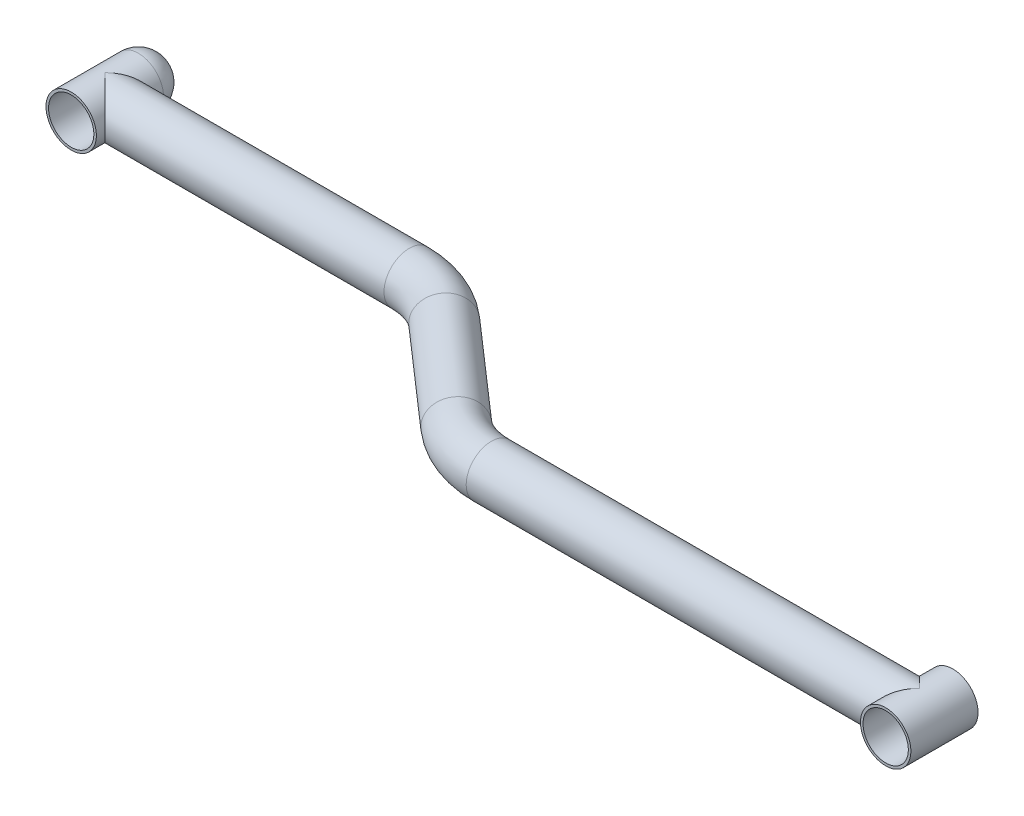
from build123d import *

# Parameters (mm, degrees)
ESQUISSE2_R             = 30
ESQUISSE2_R_2           = 27
ESQUISSE3_W             = 30
ESQUISSE3_H             = 80
ESQUISSE4_W             = 30
ESQUISSE4_H             = 80
ESQUISSE10_R            = 27
ENL_V_MAT_EXTRU_1_DEPTH = 1174.158130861
ESQUISSE11_R            = 27
ENL_V_MAT_EXTRU_2_DEPTH = 1161.129303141


with BuildPart() as part:
    # Balayage1: sweep along a path in Esquisse1
    with BuildLine(Plane(origin=(0, 0, 0), x_dir=(1, 0, 0), z_dir=(0, 1, 0))) as balayage1_path:
        Line((0, 0), (-509.593998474, 0))
        ThreePointArc((-509.593998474, 0), (-545.312521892, 6.484917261), (-576.471823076, 25.11191425))
        Line((-576.471823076, 25.11191425), (-690.600877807, 124.88808575))
        ThreePointArc((-690.600877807, 124.88808575), (-721.76017899, 143.515082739), (-757.478702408, 150))
        Line((-757.478702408, 150), (-1120, 150))
    # Esquisse2 → Balayage1 (sweep)
    with BuildSketch(Plane(origin=(0, 0, 0), x_dir=(0, 0, -1), z_dir=(1, 0, 0))):
        Circle(ESQUISSE2_R)
        Circle(ESQUISSE2_R_2, mode=Mode.SUBTRACT)
    sweep(path=balayage1_path.line)

    # Esquisse3 → R_volution1 (revolve)
    with BuildSketch(Plane(origin=(0, 0, 0), x_dir=(1, 0, 0), z_dir=(0, 1, 0)), mode=Mode.PRIVATE) as r_volution1_sk:
        with Locations((15, 0)):
            Rectangle(ESQUISSE3_W, ESQUISSE3_H)
    revolve(r_volution1_sk.sketch.rotate(Axis((0, 0, -40), (0, 0, 1)), 180), axis=Axis((0, 0, -40), (0, 0, 1)))

    # Esquisse4 → R_volution2 (revolve)
    with BuildSketch(Plane(origin=(0, 0, 0), x_dir=(1, 0, 0), z_dir=(0, 1, 0))):
        with Locations((-1135, 150)):
            Rectangle(ESQUISSE4_W, ESQUISSE4_H)
    revolve(axis=Axis((-1120, 0, -190), (0, 0, 1)))

    # Esquisse10 → Enl_v. mat.-Extru.1 (cut, through all)
    with BuildSketch(Plane.XY.offset(40)):
        Circle(ESQUISSE10_R)
    extrude(amount=-ENL_V_MAT_EXTRU_1_DEPTH, mode=Mode.SUBTRACT)

    # Esquisse11 → Enl_v. mat.-Extru.2 (cut, through all)
    with BuildSketch(Plane.XY.offset(-110)):
        with Locations((-1120, 0)):
            Circle(ESQUISSE11_R)
    extrude(amount=-ENL_V_MAT_EXTRU_2_DEPTH, mode=Mode.SUBTRACT)

    # Esquisse12 → R_volution3 (revolve)
    with BuildSketch(Plane(origin=(0, 0, 0), x_dir=(1, 0, 0), z_dir=(0, 1, 0)), mode=Mode.PRIVATE) as r_volution3_sk:
        with BuildLine():
            Line((-1120, 190), (-1150, 190))
            ThreePointArc((-1150, 190), (-1141.213203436, 211.213203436), (-1120, 220))
            Line((-1120, 220), (-1120, 190))
        make_face()
    revolve(r_volution3_sk.sketch.rotate(Axis((-1120, 0, -190), (0, 0, -1)), 180), axis=Axis((-1120, 0, -190), (0, 0, -1)))


solid = part.part
